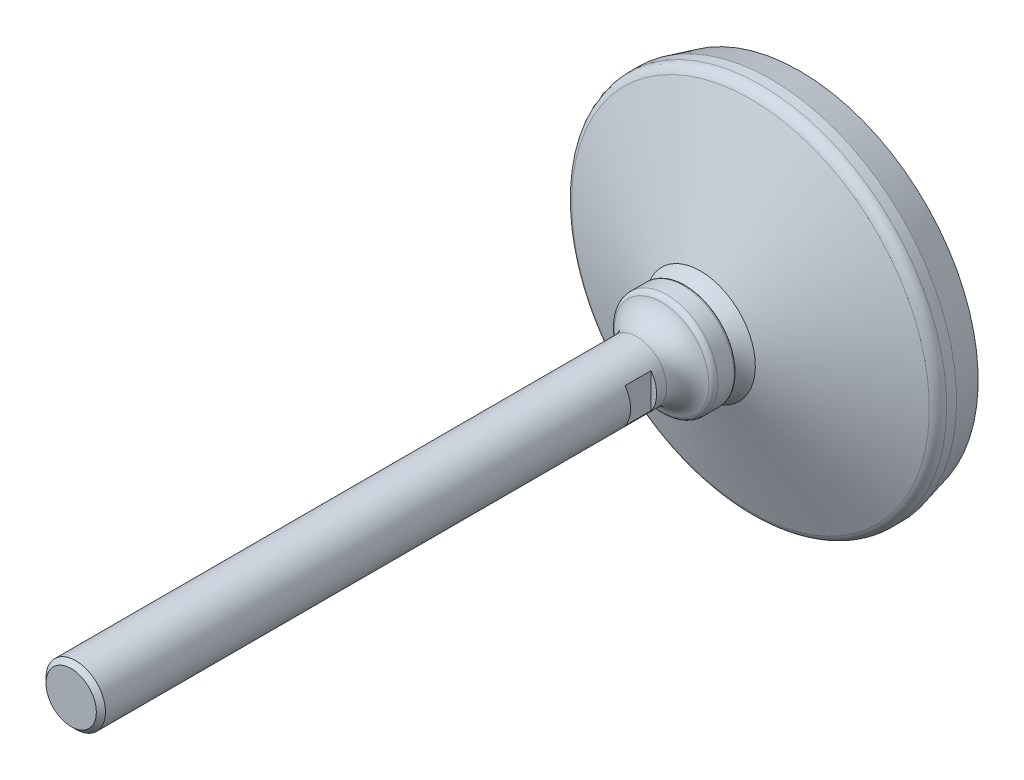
ISO-10303-21;
HEADER;
FILE_DESCRIPTION(('STEP AP214'),'2;1');
FILE_NAME('part.step','',(''),(''),'','','');
FILE_SCHEMA(('AUTOMOTIVE_DESIGN { 1 0 10303 214 1 1 1 1 }'));
ENDSEC;
DATA;
#1=APPLICATION_CONTEXT('core data for automotive mechanical design processes');
#2=APPLICATION_PROTOCOL_DEFINITION('international standard','automotive_design',2000,#1);
#3=PRODUCT_CONTEXT('',#1,'mechanical');
#4=PRODUCT('Part','Part','',(#3));
#5=PRODUCT_RELATED_PRODUCT_CATEGORY('part','',(#4));
#6=PRODUCT_DEFINITION_FORMATION('','',#4);
#7=PRODUCT_DEFINITION_CONTEXT('part definition',#1,'design');
#8=PRODUCT_DEFINITION('design','',#6,#7);
#9=PRODUCT_DEFINITION_SHAPE('','',#8);
#10=(LENGTH_UNIT() NAMED_UNIT(*) SI_UNIT(.MILLI.,.METRE.));
#11=(NAMED_UNIT(*) PLANE_ANGLE_UNIT() SI_UNIT($,.RADIAN.));
#12=(NAMED_UNIT(*) SI_UNIT($,.STERADIAN.) SOLID_ANGLE_UNIT());
#13=UNCERTAINTY_MEASURE_WITH_UNIT(LENGTH_MEASURE(1.E-05),#10,'distance_accuracy_value','');
#14=(GEOMETRIC_REPRESENTATION_CONTEXT(3) GLOBAL_UNCERTAINTY_ASSIGNED_CONTEXT((#13)) GLOBAL_UNIT_ASSIGNED_CONTEXT((#10,
#11,#12)) REPRESENTATION_CONTEXT('',''));
#15=CARTESIAN_POINT('',(0.,0.,0.));
#16=DIRECTION('',(0.,0.,1.));
#17=DIRECTION('',(1.,0.,0.));
#18=AXIS2_PLACEMENT_3D('',#15,#16,#17);
#19=CARTESIAN_POINT('',(0.,0.,35.7420167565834));
#20=DIRECTION('',(0.,0.,-1.));
#21=DIRECTION('',(0.,1.,0.));
#22=AXIS2_PLACEMENT_3D('',#19,#20,#21);
#23=TOROIDAL_SURFACE('',#22,22.6393556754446,12.0000000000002);
#24=CARTESIAN_POINT('',(0.,0.,26.7));
#25=DIRECTION('',(0.,0.,-1.));
#26=DIRECTION('',(0.,1.,0.));
#27=AXIS2_PLACEMENT_3D('',#24,#25,#26);
#28=CIRCLE('',#27,14.75);
#29=CARTESIAN_POINT('',(0.,14.75,26.7));
#30=VERTEX_POINT('',#29);
#31=EDGE_CURVE('E86',#30,#30,#28,.T.);
#32=ORIENTED_EDGE('',*,*,#31,.F.);
#33=EDGE_LOOP('',(#32));
#34=FACE_BOUND('',#33,.T.);
#35=CARTESIAN_POINT('',(0.,0.,30.7));
#36=DIRECTION('',(0.,0.,-1.));
#37=DIRECTION('',(0.,1.,0.));
#38=AXIS2_PLACEMENT_3D('',#35,#36,#37);
#39=CIRCLE('',#38,11.75);
#40=CARTESIAN_POINT('',(0.,11.75,30.7));
#41=VERTEX_POINT('',#40);
#42=EDGE_CURVE('E61',#41,#41,#39,.T.);
#43=ORIENTED_EDGE('',*,*,#42,.T.);
#44=EDGE_LOOP('',(#43));
#45=FACE_BOUND('',#44,.T.);
#46=ADVANCED_FACE('F14',(#34,#45),#23,.F.);
#47=CARTESIAN_POINT('',(0.,0.,26.7));
#48=DIRECTION('',(0.,0.,-1.));
#49=DIRECTION('',(0.,1.,0.));
#50=AXIS2_PLACEMENT_3D('',#47,#48,#49);
#51=CONICAL_SURFACE('',#50,14.75,1.18784675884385);
#52=CARTESIAN_POINT('',(0.,0.,13.2569409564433));
#53=DIRECTION('',(0.,0.,-1.));
#54=DIRECTION('',(0.,1.,0.));
#55=AXIS2_PLACEMENT_3D('',#52,#53,#54);
#56=CIRCLE('',#55,48.1209740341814);
#57=CARTESIAN_POINT('',(0.,48.1209740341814,13.2569409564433));
#58=VERTEX_POINT('',#57);
#59=EDGE_CURVE('E89',#58,#58,#56,.T.);
#60=CARTESIAN_POINT('',(0.,48.1209740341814,13.2569409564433));
#61=CARTESIAN_POINT('',(0.,47.7733597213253,13.3969728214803));
#62=CARTESIAN_POINT('',(0.,47.4257454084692,13.5370046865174));
#63=CARTESIAN_POINT('',(0.,46.7305167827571,13.8170684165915));
#64=CARTESIAN_POINT('',(0.,46.3829024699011,13.9571002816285));
#65=CARTESIAN_POINT('',(0.,45.687673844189,14.2371640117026));
#66=CARTESIAN_POINT('',(0.,45.3400595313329,14.3771958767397));
#67=CARTESIAN_POINT('',(0.,44.6448309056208,14.6572596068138));
#68=CARTESIAN_POINT('',(0.,44.2972165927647,14.7972914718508));
#69=CARTESIAN_POINT('',(0.,43.6019879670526,15.0773552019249));
#70=CARTESIAN_POINT('',(0.,43.2543736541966,15.217387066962));
#71=CARTESIAN_POINT('',(0.,42.5591450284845,15.4974507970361));
#72=CARTESIAN_POINT('',(0.,42.2115307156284,15.6374826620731));
#73=CARTESIAN_POINT('',(0.,41.5163020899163,15.9175463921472));
#74=CARTESIAN_POINT('',(0.,41.1686877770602,16.0575782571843));
#75=CARTESIAN_POINT('',(0.,40.4734591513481,16.3376419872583));
#76=CARTESIAN_POINT('',(0.,40.1258448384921,16.4776738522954));
#77=CARTESIAN_POINT('',(0.,39.43061621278,16.7577375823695));
#78=CARTESIAN_POINT('',(0.,39.0830018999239,16.8977694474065));
#79=CARTESIAN_POINT('',(0.,38.3877732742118,17.1778331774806));
#80=CARTESIAN_POINT('',(0.,38.0401589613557,17.3178650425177));
#81=CARTESIAN_POINT('',(0.,37.3449303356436,17.5979287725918));
#82=CARTESIAN_POINT('',(0.,36.9973160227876,17.7379606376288));
#83=CARTESIAN_POINT('',(0.,36.3020873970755,18.0180243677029));
#84=CARTESIAN_POINT('',(0.,35.9544730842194,18.15805623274));
#85=CARTESIAN_POINT('',(0.,35.2592444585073,18.4381199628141));
#86=CARTESIAN_POINT('',(0.,34.9116301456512,18.5781518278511));
#87=CARTESIAN_POINT('',(0.,34.2164015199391,18.8582155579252));
#88=CARTESIAN_POINT('',(0.,33.8687872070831,18.9982474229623));
#89=CARTESIAN_POINT('',(0.,33.173558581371,19.2783111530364));
#90=CARTESIAN_POINT('',(0.,32.8259442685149,19.4183430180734));
#91=CARTESIAN_POINT('',(0.,32.1307156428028,19.6984067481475));
#92=CARTESIAN_POINT('',(0.,31.7831013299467,19.8384386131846));
#93=CARTESIAN_POINT('',(0.,31.0878727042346,20.1185023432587));
#94=CARTESIAN_POINT('',(0.,30.7402583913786,20.2585342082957));
#95=CARTESIAN_POINT('',(0.,30.0450297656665,20.5385979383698));
#96=CARTESIAN_POINT('',(0.,29.6974154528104,20.6786298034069));
#97=CARTESIAN_POINT('',(0.,29.0021868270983,20.958693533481));
#98=CARTESIAN_POINT('',(0.,28.6545725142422,21.098725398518));
#99=CARTESIAN_POINT('',(0.,27.9593438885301,21.3787891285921));
#100=CARTESIAN_POINT('',(0.,27.6117295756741,21.5188209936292));
#101=CARTESIAN_POINT('',(0.,26.916500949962,21.7988847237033));
#102=CARTESIAN_POINT('',(0.,26.5688866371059,21.9389165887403));
#103=CARTESIAN_POINT('',(0.,25.8736580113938,22.2189803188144));
#104=CARTESIAN_POINT('',(0.,25.5260436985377,22.3590121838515));
#105=CARTESIAN_POINT('',(0.,24.8308150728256,22.6390759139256));
#106=CARTESIAN_POINT('',(0.,24.4832007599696,22.7791077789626));
#107=CARTESIAN_POINT('',(0.,23.7879721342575,23.0591715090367));
#108=CARTESIAN_POINT('',(0.,23.4403578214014,23.1992033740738));
#109=CARTESIAN_POINT('',(0.,22.7451291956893,23.4792671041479));
#110=CARTESIAN_POINT('',(0.,22.3975148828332,23.6192989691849));
#111=CARTESIAN_POINT('',(0.,21.7022862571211,23.899362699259));
#112=CARTESIAN_POINT('',(0.,21.3546719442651,24.0393945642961));
#113=CARTESIAN_POINT('',(0.,20.6594433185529,24.3194582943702));
#114=CARTESIAN_POINT('',(0.,20.3118290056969,24.4594901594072));
#115=CARTESIAN_POINT('',(0.,19.6166003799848,24.7395538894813));
#116=CARTESIAN_POINT('',(0.,19.2689860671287,24.8795857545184));
#117=CARTESIAN_POINT('',(0.,18.5737574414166,25.1596494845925));
#118=CARTESIAN_POINT('',(0.,18.2261431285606,25.2996813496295));
#119=CARTESIAN_POINT('',(0.,17.5309145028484,25.5797450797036));
#120=CARTESIAN_POINT('',(0.,17.1833001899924,25.7197769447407));
#121=CARTESIAN_POINT('',(0.,16.4880715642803,25.9998406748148));
#122=CARTESIAN_POINT('',(0.,16.1404572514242,26.1398725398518));
#123=CARTESIAN_POINT('',(0.,15.4452286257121,26.4199362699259));
#124=CARTESIAN_POINT('',(0.,15.0976143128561,26.559968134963));
#125=CARTESIAN_POINT('',(0.,14.75,26.7));
#126=B_SPLINE_CURVE_WITH_KNOTS('',3,(#60,#61,#62,#63,#64,#65,#66,#67,#68,#69,#70,#71,#72,#73,
#74,#75,#76,#77,#78,#79,#80,#81,#82,#83,#84,#85,#86,#87,#88,#89,#90,#91,#92,#93,#94,#95,#96,#97,
#98,#99,#100,#101,#102,#103,#104,#105,#106,#107,#108,#109,#110,#111,#112,#113,#114,#115,#116,
#117,#118,#119,#120,#121,#122,#123,#124,#125),.UNSPECIFIED.,.F.,.F.,(4,2,2,2,2,2,2,2,2,2,2,2,2,
2,2,2,2,2,2,2,2,2,2,2,2,2,2,2,2,2,2,2,4),(0.,1.12427830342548,2.24855660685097,3.37283491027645,
4.49711321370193,5.62139151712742,6.74566982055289,7.86994812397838,8.99422642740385,
10.1185047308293,11.2427830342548,12.3670613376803,13.4913396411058,14.6156179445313,
15.7398962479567,16.8641745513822,17.9884528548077,19.1127311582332,20.2370094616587,
21.3612877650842,22.4855660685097,23.6098443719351,24.7341226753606,25.8584009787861,
26.9826792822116,28.1069575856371,29.2312358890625,30.355514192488,31.4797924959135,
32.604070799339,33.7283491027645,34.85262740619,35.9769057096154),.UNSPECIFIED.);
#127=EDGE_CURVE('BSEAM147',#58,#30,#126,.T.);
#128=ORIENTED_EDGE('',*,*,#59,.F.);
#129=ORIENTED_EDGE('',*,*,#31,.T.);
#130=ORIENTED_EDGE('',*,*,#127,.T.);
#131=ORIENTED_EDGE('',*,*,#127,.F.);
#132=EDGE_LOOP('',(#128,#130,#129,#131));
#133=FACE_BOUND('',#132,.T.);
#134=ADVANCED_FACE('F147',(#133),#51,.T.);
#135=CARTESIAN_POINT('',(0.,0.,10.4742413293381));
#136=DIRECTION('',(0.,0.,-1.));
#137=DIRECTION('',(0.,1.,0.));
#138=AXIS2_PLACEMENT_3D('',#135,#136,#137);
#139=TOROIDAL_SURFACE('',#138,47.,3.);
#140=ORIENTED_EDGE('',*,*,#59,.T.);
#141=EDGE_LOOP('',(#140));
#142=FACE_BOUND('',#141,.T.);
#143=CARTESIAN_POINT('',(0.,0.,10.4742413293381));
#144=DIRECTION('',(0.,0.,-1.));
#145=DIRECTION('',(0.,1.,0.));
#146=AXIS2_PLACEMENT_3D('',#143,#144,#145);
#147=CIRCLE('',#146,50.);
#148=CARTESIAN_POINT('',(0.,50.,10.4742413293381));
#149=VERTEX_POINT('',#148);
#150=EDGE_CURVE('E92',#149,#149,#147,.T.);
#151=ORIENTED_EDGE('',*,*,#150,.F.);
#152=EDGE_LOOP('',(#151));
#153=FACE_BOUND('',#152,.T.);
#154=ADVANCED_FACE('F153',(#142,#153),#139,.T.);
#155=CARTESIAN_POINT('',(0.,0.,0.));
#156=DIRECTION('',(0.,0.,-1.));
#157=DIRECTION('',(0.,1.,0.));
#158=AXIS2_PLACEMENT_3D('',#155,#156,#157);
#159=CYLINDRICAL_SURFACE('',#158,50.);
#160=CARTESIAN_POINT('',(0.,0.,7.8));
#161=DIRECTION('',(0.,0.,-1.));
#162=DIRECTION('',(0.,1.,0.));
#163=AXIS2_PLACEMENT_3D('',#160,#161,#162);
#164=CIRCLE('',#163,50.);
#165=CARTESIAN_POINT('',(0.,50.,7.8));
#166=VERTEX_POINT('',#165);
#167=EDGE_CURVE('E95',#166,#166,#164,.T.);
#168=ORIENTED_EDGE('',*,*,#167,.F.);
#169=EDGE_LOOP('',(#168));
#170=FACE_BOUND('',#169,.T.);
#171=ORIENTED_EDGE('',*,*,#150,.T.);
#172=EDGE_LOOP('',(#171));
#173=FACE_BOUND('',#172,.T.);
#174=ADVANCED_FACE('F198',(#170,#173),#159,.T.);
#175=CARTESIAN_POINT('',(0.,0.,7.8));
#176=DIRECTION('',(0.,0.,1.));
#177=DIRECTION('',(0.,-1.,0.));
#178=AXIS2_PLACEMENT_3D('',#175,#176,#177);
#179=CONICAL_SURFACE('',#178,50.,0.251002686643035);
#180=CARTESIAN_POINT('',(0.,0.,0.));
#181=DIRECTION('',(0.,0.,-1.));
#182=DIRECTION('',(0.,1.,0.));
#183=AXIS2_PLACEMENT_3D('',#180,#181,#182);
#184=CIRCLE('',#183,48.);
#185=CARTESIAN_POINT('',(0.,48.,0.));
#186=VERTEX_POINT('',#185);
#187=EDGE_CURVE('E98',#186,#186,#184,.T.);
#188=ORIENTED_EDGE('',*,*,#187,.F.);
#189=EDGE_LOOP('',(#188));
#190=FACE_BOUND('',#189,.T.);
#191=ORIENTED_EDGE('',*,*,#167,.T.);
#192=EDGE_LOOP('',(#191));
#193=FACE_BOUND('',#192,.T.);
#194=ADVANCED_FACE('F194',(#190,#193),#179,.T.);
#195=CARTESIAN_POINT('',(48.,0.,0.));
#196=DIRECTION('',(0.,0.,1.));
#197=DIRECTION('',(0.,-1.,0.));
#198=AXIS2_PLACEMENT_3D('',#195,#196,#197);
#199=PLANE('',#198);
#200=ORIENTED_EDGE('',*,*,#187,.T.);
#201=EDGE_LOOP('',(#200));
#202=FACE_BOUND('',#201,.T.);
#203=ADVANCED_FACE('F187',(#202),#199,.F.);
#204=CARTESIAN_POINT('',(0.,0.,14.));
#205=DIRECTION('',(0.,0.,-1.));
#206=DIRECTION('',(0.,1.,0.));
#207=AXIS2_PLACEMENT_3D('',#204,#205,#206);
#208=CYLINDRICAL_SURFACE('',#207,8.);
#209=CARTESIAN_POINT('',(0.,0.,43.8));
#210=DIRECTION('',(0.,0.,-1.));
#211=DIRECTION('',(0.,1.,0.));
#212=AXIS2_PLACEMENT_3D('',#209,#210,#211);
#213=CIRCLE('',#212,8.);
#214=CARTESIAN_POINT('',(0.,8.,43.8));
#215=VERTEX_POINT('',#214);
#216=EDGE_CURVE('E107',#215,#215,#213,.T.);
#217=ORIENTED_EDGE('',*,*,#216,.F.);
#218=EDGE_LOOP('',(#217));
#219=FACE_BOUND('',#218,.T.);
#220=DIRECTION('',(0.,0.,-1.));
#221=VECTOR('',#220,1.);
#222=CARTESIAN_POINT('',(6.5,-4.66368952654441,14.));
#223=LINE('',#222,#221);
#224=CARTESIAN_POINT('',(6.5,-4.66368952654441,46.5));
#225=VERTEX_POINT('',#224);
#226=CARTESIAN_POINT('',(6.5,-4.66368952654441,53.5));
#227=VERTEX_POINT('',#226);
#228=EDGE_CURVE('E77',#225,#227,#223,.F.);
#229=ORIENTED_EDGE('',*,*,#228,.T.);
#230=CARTESIAN_POINT('',(0.,0.,53.5));
#231=DIRECTION('',(0.,0.,1.));
#232=DIRECTION('',(0.,-1.,0.));
#233=AXIS2_PLACEMENT_3D('',#230,#231,#232);
#234=CIRCLE('',#233,8.);
#235=CARTESIAN_POINT('',(6.5,4.66368952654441,53.5));
#236=VERTEX_POINT('',#235);
#237=EDGE_CURVE('E9',#227,#236,#234,.T.);
#238=ORIENTED_EDGE('',*,*,#237,.T.);
#239=DIRECTION('',(0.,0.,-1.));
#240=VECTOR('',#239,1.);
#241=CARTESIAN_POINT('',(6.5,4.66368952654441,14.));
#242=LINE('',#241,#240);
#243=CARTESIAN_POINT('',(6.5,4.66368952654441,46.5));
#244=VERTEX_POINT('',#243);
#245=EDGE_CURVE('E17',#236,#244,#242,.T.);
#246=ORIENTED_EDGE('',*,*,#245,.T.);
#247=CARTESIAN_POINT('',(0.,0.,46.5));
#248=DIRECTION('',(0.,0.,1.));
#249=DIRECTION('',(0.,-1.,0.));
#250=AXIS2_PLACEMENT_3D('',#247,#248,#249);
#251=CIRCLE('',#250,8.);
#252=EDGE_CURVE('E63',#225,#244,#251,.T.);
#253=ORIENTED_EDGE('',*,*,#252,.F.);
#254=EDGE_LOOP('',(#229,#238,#246,#253));
#255=FACE_BOUND('',#254,.T.);
#256=DIRECTION('',(0.,0.,-1.));
#257=VECTOR('',#256,1.);
#258=CARTESIAN_POINT('',(-6.5,4.66368952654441,14.));
#259=LINE('',#258,#257);
#260=CARTESIAN_POINT('',(-6.5,4.66368952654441,46.5));
#261=VERTEX_POINT('',#260);
#262=CARTESIAN_POINT('',(-6.5,4.66368952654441,53.5));
#263=VERTEX_POINT('',#262);
#264=EDGE_CURVE('E60',#261,#263,#259,.F.);
#265=ORIENTED_EDGE('',*,*,#264,.T.);
#266=CARTESIAN_POINT('',(-6.5,-4.66368952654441,53.5));
#267=VERTEX_POINT('',#266);
#268=EDGE_CURVE('E23',#263,#267,#234,.T.);
#269=ORIENTED_EDGE('',*,*,#268,.T.);
#270=DIRECTION('',(0.,0.,-1.));
#271=VECTOR('',#270,1.);
#272=CARTESIAN_POINT('',(-6.5,-4.66368952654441,14.));
#273=LINE('',#272,#271);
#274=CARTESIAN_POINT('',(-6.5,-4.66368952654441,46.5));
#275=VERTEX_POINT('',#274);
#276=EDGE_CURVE('E67',#267,#275,#273,.T.);
#277=ORIENTED_EDGE('',*,*,#276,.T.);
#278=EDGE_CURVE('E55',#261,#275,#251,.T.);
#279=ORIENTED_EDGE('',*,*,#278,.F.);
#280=EDGE_LOOP('',(#265,#269,#277,#279));
#281=FACE_BOUND('',#280,.T.);
#282=CARTESIAN_POINT('',(0.,0.,194.773));
#283=DIRECTION('',(0.,0.,-1.));
#284=DIRECTION('',(0.,1.,0.));
#285=AXIS2_PLACEMENT_3D('',#282,#283,#284);
#286=CIRCLE('',#285,8.);
#287=CARTESIAN_POINT('',(0.,8.,194.773));
#288=VERTEX_POINT('',#287);
#289=EDGE_CURVE('E104',#288,#288,#286,.T.);
#290=ORIENTED_EDGE('',*,*,#289,.T.);
#291=EDGE_LOOP('',(#290));
#292=FACE_BOUND('',#291,.T.);
#293=ADVANCED_FACE('F73',(#219,#255,#281,#292),#208,.T.);
#294=CARTESIAN_POINT('',(0.,0.,43.8));
#295=DIRECTION('',(0.,0.,-1.));
#296=DIRECTION('',(0.,1.,0.));
#297=AXIS2_PLACEMENT_3D('',#294,#295,#296);
#298=TOROIDAL_SURFACE('',#297,15.,7.);
#299=CARTESIAN_POINT('',(0.,0.,37.176473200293));
#300=DIRECTION('',(0.,0.,-1.));
#301=DIRECTION('',(0.,1.,0.));
#302=AXIS2_PLACEMENT_3D('',#299,#300,#301);
#303=CIRCLE('',#302,12.7352941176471);
#304=CARTESIAN_POINT('',(0.,12.7352941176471,37.176473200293));
#305=VERTEX_POINT('',#304);
#306=EDGE_CURVE('E110',#305,#305,#303,.T.);
#307=ORIENTED_EDGE('',*,*,#306,.F.);
#308=EDGE_LOOP('',(#307));
#309=FACE_BOUND('',#308,.T.);
#310=ORIENTED_EDGE('',*,*,#216,.T.);
#311=EDGE_LOOP('',(#310));
#312=FACE_BOUND('',#311,.T.);
#313=ADVANCED_FACE('F180',(#309,#312),#298,.F.);
#314=CARTESIAN_POINT('',(0.,0.,35.7571460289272));
#315=DIRECTION('',(0.,0.,-1.));
#316=DIRECTION('',(0.,1.,0.));
#317=AXIS2_PLACEMENT_3D('',#314,#315,#316);
#318=TOROIDAL_SURFACE('',#317,12.25,1.50000000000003);
#319=ORIENTED_EDGE('',*,*,#306,.T.);
#320=EDGE_LOOP('',(#319));
#321=FACE_BOUND('',#320,.T.);
#322=CARTESIAN_POINT('',(0.,0.,35.7571460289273));
#323=DIRECTION('',(0.,0.,-1.));
#324=DIRECTION('',(0.,1.,0.));
#325=AXIS2_PLACEMENT_3D('',#322,#323,#324);
#326=CIRCLE('',#325,13.75);
#327=CARTESIAN_POINT('',(0.,13.75,35.7571460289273));
#328=VERTEX_POINT('',#327);
#329=EDGE_CURVE('E113',#328,#328,#326,.T.);
#330=ORIENTED_EDGE('',*,*,#329,.F.);
#331=EDGE_LOOP('',(#330));
#332=FACE_BOUND('',#331,.T.);
#333=ADVANCED_FACE('F173',(#321,#332),#318,.T.);
#334=CARTESIAN_POINT('',(0.,0.,14.));
#335=DIRECTION('',(0.,0.,-1.));
#336=DIRECTION('',(0.,1.,0.));
#337=AXIS2_PLACEMENT_3D('',#334,#335,#336);
#338=CYLINDRICAL_SURFACE('',#337,13.75);
#339=CARTESIAN_POINT('',(0.,0.,31.45));
#340=DIRECTION('',(0.,0.,-1.));
#341=DIRECTION('',(0.,1.,0.));
#342=AXIS2_PLACEMENT_3D('',#339,#340,#341);
#343=CIRCLE('',#342,13.75);
#344=CARTESIAN_POINT('',(0.,13.75,31.45));
#345=VERTEX_POINT('',#344);
#346=EDGE_CURVE('E116',#345,#345,#343,.T.);
#347=ORIENTED_EDGE('',*,*,#346,.F.);
#348=EDGE_LOOP('',(#347));
#349=FACE_BOUND('',#348,.T.);
#350=ORIENTED_EDGE('',*,*,#329,.T.);
#351=EDGE_LOOP('',(#350));
#352=FACE_BOUND('',#351,.T.);
#353=ADVANCED_FACE('F166',(#349,#352),#338,.T.);
#354=CARTESIAN_POINT('',(0.,0.,31.45));
#355=DIRECTION('',(0.,0.,-1.));
#356=DIRECTION('',(0.,1.,0.));
#357=AXIS2_PLACEMENT_3D('',#354,#355,#356);
#358=TOROIDAL_SURFACE('',#357,13.,0.75);
#359=ORIENTED_EDGE('',*,*,#346,.T.);
#360=EDGE_LOOP('',(#359));
#361=FACE_BOUND('',#360,.T.);
#362=CARTESIAN_POINT('',(0.,0.,30.7));
#363=DIRECTION('',(0.,0.,-1.));
#364=DIRECTION('',(0.,1.,0.));
#365=AXIS2_PLACEMENT_3D('',#362,#363,#364);
#366=CIRCLE('',#365,13.);
#367=CARTESIAN_POINT('',(0.,13.,30.7));
#368=VERTEX_POINT('',#367);
#369=EDGE_CURVE('E119',#368,#368,#366,.T.);
#370=ORIENTED_EDGE('',*,*,#369,.F.);
#371=EDGE_LOOP('',(#370));
#372=FACE_BOUND('',#371,.T.);
#373=ADVANCED_FACE('F161',(#361,#372),#358,.T.);
#374=CARTESIAN_POINT('',(13.,0.,30.7));
#375=DIRECTION('',(0.,0.,1.));
#376=DIRECTION('',(0.,-1.,0.));
#377=AXIS2_PLACEMENT_3D('',#374,#375,#376);
#378=PLANE('',#377);
#379=ORIENTED_EDGE('',*,*,#42,.F.);
#380=EDGE_LOOP('',(#379));
#381=FACE_BOUND('',#380,.T.);
#382=ORIENTED_EDGE('',*,*,#369,.T.);
#383=EDGE_LOOP('',(#382));
#384=FACE_BOUND('',#383,.T.);
#385=ADVANCED_FACE('F145',(#381,#384),#378,.F.);
#386=CARTESIAN_POINT('',(0.,0.,46.5));
#387=DIRECTION('',(0.,0.,1.));
#388=DIRECTION('',(0.,-1.,0.));
#389=AXIS2_PLACEMENT_3D('',#386,#387,#388);
#390=PLANE('',#389);
#391=ORIENTED_EDGE('',*,*,#278,.T.);
#392=DIRECTION('',(0.,-1.,0.));
#393=VECTOR('',#392,1.);
#394=CARTESIAN_POINT('',(-6.5,16.,46.5));
#395=LINE('',#394,#393);
#396=EDGE_CURVE('E29',#261,#275,#395,.T.);
#397=ORIENTED_EDGE('',*,*,#396,.F.);
#398=EDGE_LOOP('',(#391,#397));
#399=FACE_BOUND('',#398,.T.);
#400=ADVANCED_FACE('F56',(#399),#390,.T.);
#401=CARTESIAN_POINT('',(0.,0.,53.5));
#402=DIRECTION('',(0.,0.,1.));
#403=DIRECTION('',(0.,-1.,0.));
#404=AXIS2_PLACEMENT_3D('',#401,#402,#403);
#405=PLANE('',#404);
#406=DIRECTION('',(0.,-1.,0.));
#407=VECTOR('',#406,1.);
#408=CARTESIAN_POINT('',(-6.5,16.,53.5));
#409=LINE('',#408,#407);
#410=EDGE_CURVE('E121',#263,#267,#409,.T.);
#411=ORIENTED_EDGE('',*,*,#410,.T.);
#412=ORIENTED_EDGE('',*,*,#268,.F.);
#413=EDGE_LOOP('',(#411,#412));
#414=FACE_BOUND('',#413,.T.);
#415=ADVANCED_FACE('F142',(#414),#405,.F.);
#416=CARTESIAN_POINT('',(-6.5,16.,53.5));
#417=DIRECTION('',(1.,0.,0.));
#418=DIRECTION('',(0.,1.,0.));
#419=AXIS2_PLACEMENT_3D('',#416,#417,#418);
#420=PLANE('',#419);
#421=ORIENTED_EDGE('',*,*,#410,.F.);
#422=ORIENTED_EDGE('',*,*,#264,.F.);
#423=ORIENTED_EDGE('',*,*,#396,.T.);
#424=ORIENTED_EDGE('',*,*,#276,.F.);
#425=EDGE_LOOP('',(#421,#422,#423,#424));
#426=FACE_BOUND('',#425,.T.);
#427=ADVANCED_FACE('F66',(#426),#420,.F.);
#428=CARTESIAN_POINT('',(6.5,-16.,53.5));
#429=DIRECTION('',(-1.,0.,0.));
#430=DIRECTION('',(0.,-1.,0.));
#431=AXIS2_PLACEMENT_3D('',#428,#429,#430);
#432=PLANE('',#431);
#433=DIRECTION('',(0.,1.,0.));
#434=VECTOR('',#433,1.);
#435=CARTESIAN_POINT('',(6.5,-16.,53.5));
#436=LINE('',#435,#434);
#437=EDGE_CURVE('E69',#227,#236,#436,.T.);
#438=ORIENTED_EDGE('',*,*,#437,.F.);
#439=ORIENTED_EDGE('',*,*,#228,.F.);
#440=DIRECTION('',(0.,1.,0.));
#441=VECTOR('',#440,1.);
#442=CARTESIAN_POINT('',(6.5,-16.,46.5));
#443=LINE('',#442,#441);
#444=EDGE_CURVE('E70',#225,#244,#443,.T.);
#445=ORIENTED_EDGE('',*,*,#444,.T.);
#446=ORIENTED_EDGE('',*,*,#245,.F.);
#447=EDGE_LOOP('',(#438,#439,#445,#446));
#448=FACE_BOUND('',#447,.T.);
#449=ADVANCED_FACE('F127',(#448),#432,.F.);
#450=ORIENTED_EDGE('',*,*,#437,.T.);
#451=ORIENTED_EDGE('',*,*,#237,.F.);
#452=EDGE_LOOP('',(#450,#451));
#453=FACE_BOUND('',#452,.T.);
#454=ADVANCED_FACE('F126',(#453),#405,.F.);
#455=ORIENTED_EDGE('',*,*,#444,.F.);
#456=ORIENTED_EDGE('',*,*,#252,.T.);
#457=EDGE_LOOP('',(#455,#456));
#458=FACE_BOUND('',#457,.T.);
#459=ADVANCED_FACE('F128',(#458),#390,.T.);
#460=CARTESIAN_POINT('',(0.,0.,196.));
#461=DIRECTION('',(0.,0.,-1.));
#462=DIRECTION('',(0.,1.,0.));
#463=AXIS2_PLACEMENT_3D('',#460,#461,#462);
#464=PLANE('',#463);
#465=CARTESIAN_POINT('',(0.,0.,196.));
#466=DIRECTION('',(0.,0.,-1.));
#467=DIRECTION('',(0.,1.,0.));
#468=AXIS2_PLACEMENT_3D('',#465,#466,#467);
#469=CIRCLE('',#468,6.773);
#470=CARTESIAN_POINT('',(0.,6.773,196.));
#471=VERTEX_POINT('',#470);
#472=EDGE_CURVE('E101',#471,#471,#469,.T.);
#473=ORIENTED_EDGE('',*,*,#472,.F.);
#474=EDGE_LOOP('',(#473));
#475=FACE_BOUND('',#474,.T.);
#476=ADVANCED_FACE('F130',(#475),#464,.F.);
#477=CARTESIAN_POINT('',(0.,0.,196.));
#478=DIRECTION('',(0.,0.,-1.));
#479=DIRECTION('',(0.,1.,0.));
#480=AXIS2_PLACEMENT_3D('',#477,#478,#479);
#481=CONICAL_SURFACE('',#480,6.773,0.785398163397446);
#482=ORIENTED_EDGE('',*,*,#289,.F.);
#483=EDGE_LOOP('',(#482));
#484=FACE_BOUND('',#483,.T.);
#485=ORIENTED_EDGE('',*,*,#472,.T.);
#486=EDGE_LOOP('',(#485));
#487=FACE_BOUND('',#486,.T.);
#488=ADVANCED_FACE('F138',(#484,#487),#481,.T.);
#489=CLOSED_SHELL('',(#46,#134,#154,#174,#194,#203,#293,#313,#333,#353,#373,#385,#400,#415,#427,
#449,#454,#459,#476,#488));
#490=MANIFOLD_SOLID_BREP('B1',#489);
#491=ADVANCED_BREP_SHAPE_REPRESENTATION('',(#18,#490),#14);
#492=SHAPE_DEFINITION_REPRESENTATION(#9,#491);
ENDSEC;
END-ISO-10303-21;
